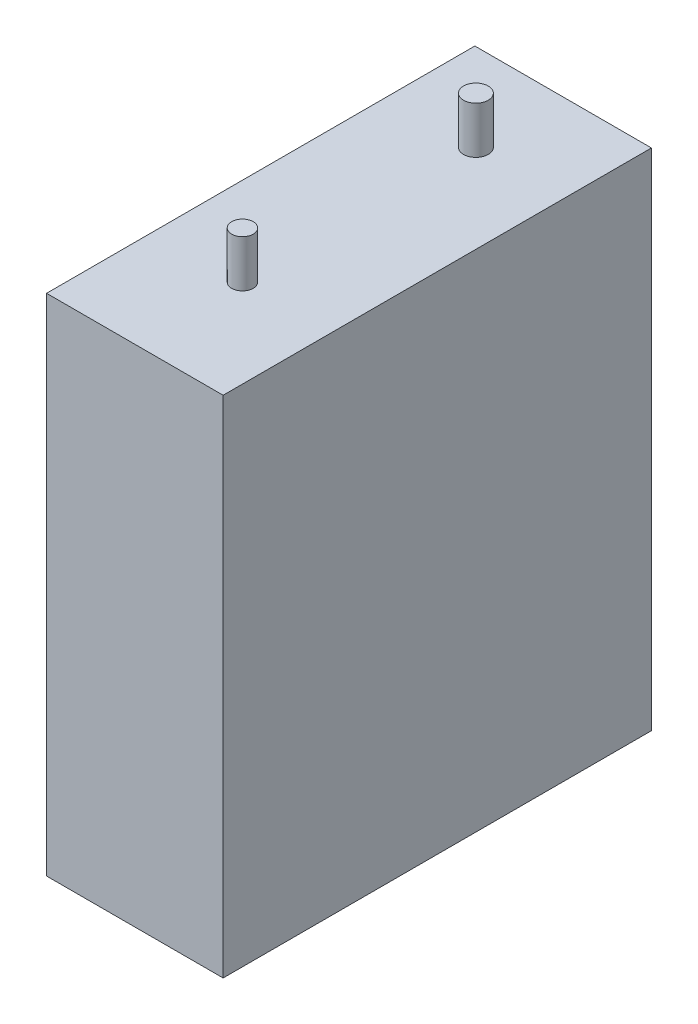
from build123d import *

# Parameters (mm, degrees)
SKETCH1_W           = 173.736
SKETCH1_H           = 204.724
BOSS_EXTRUDE1_DEPTH = 35.814
SKETCH2_R           = 5.005448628
SKETCH2_R_2         = 4.377137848
BOSS_EXTRUDE2_DEPTH = 19.05


with BuildPart() as part:
    # Sketch1 → Boss-Extrude1 (new, symmetric)
    with BuildSketch(Plane(origin=(0, 0, 0), x_dir=(0, 0, -1), z_dir=(1, 0, 0))):
        Rectangle(SKETCH1_W, SKETCH1_H)
    extrude(amount=BOSS_EXTRUDE1_DEPTH, both=True)

    # Sketch2 → Boss-Extrude2 (add)
    with BuildSketch(Plane(origin=(0, 102.362, 0), x_dir=(1, 0, 0), z_dir=(0, 1, 0))):
        with Locations(Location((0, 51.473583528, 0), (0, 0, 90))):
            Circle(SKETCH2_R)
        with Locations(Location((0, -43.218386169, 0), (0, 0, 90))):
            Circle(SKETCH2_R_2)
    extrude(amount=BOSS_EXTRUDE2_DEPTH)


solid = part.part
